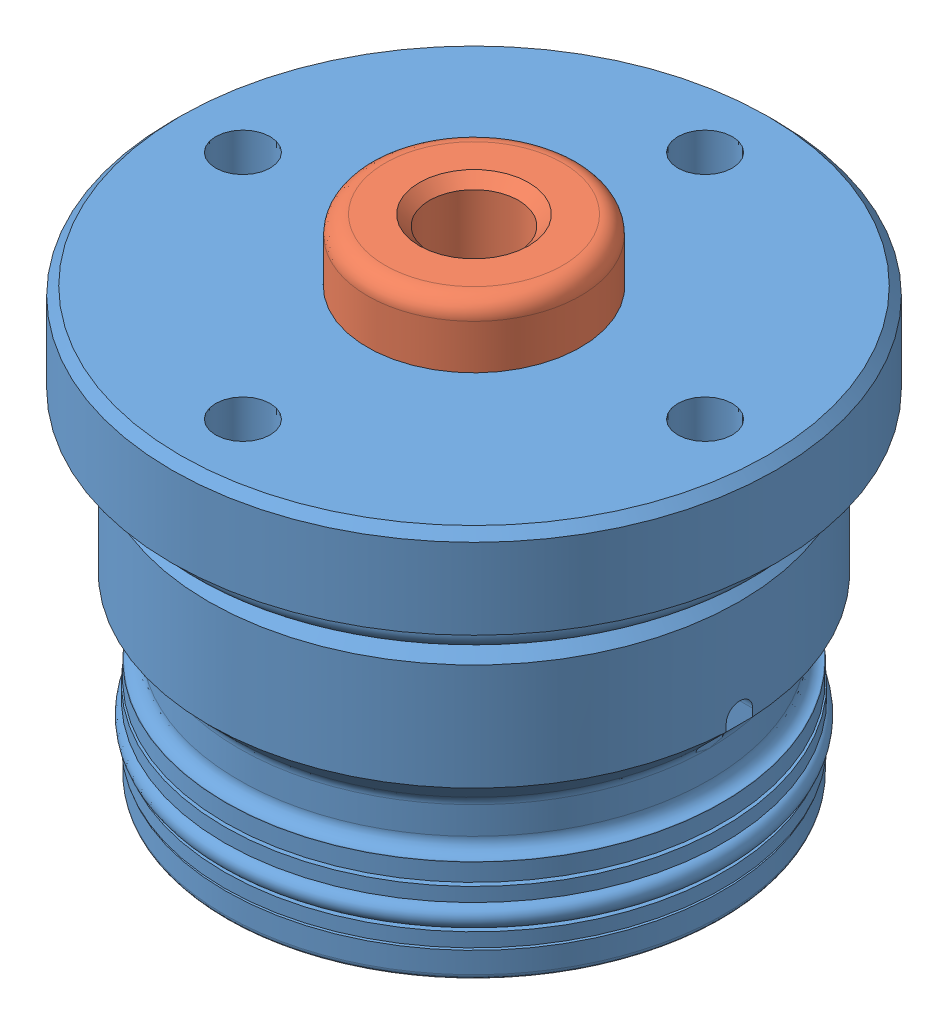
SolidWorks assembly ILC21021300.sldasm, configuration Default (file format 3400). Lengths in mm.
Overall size (53.98 43.64 53.98).
2 component instances, 2 part files, 3 mates.
Components (placement in the parent):
- ILC21021300_BODY-1: ILC21021300_BODY.sldprt [Default] at origin size (53.98 38.1 53.98)
- ILC21021300_PLUNGER-1: ILC21021300_PLUNGER.sldprt [Default] at (0 3.175 0) x (0 1 0) z (0 0 1) size (40.46 34.92 34.92)
Mates (geometry in assembly coordinates):
- MID STROKE: distance = 3.175 mm aligned: plane of ILC21021300_BODY-1 through (-22.1869 0 0) normal (0 -1 0); plane of ILC21021300_PLUNGER-1 through (-6.7437 3.175 0) normal (0 -1 0)
- Concentric1: concentric aligned: cylinder of ILC21021300_BODY-1; cylinder of ILC21021300_PLUNGER-1
- Coincident2: coincident aligned: unknown of ILC21021300_PLUNGER-1
